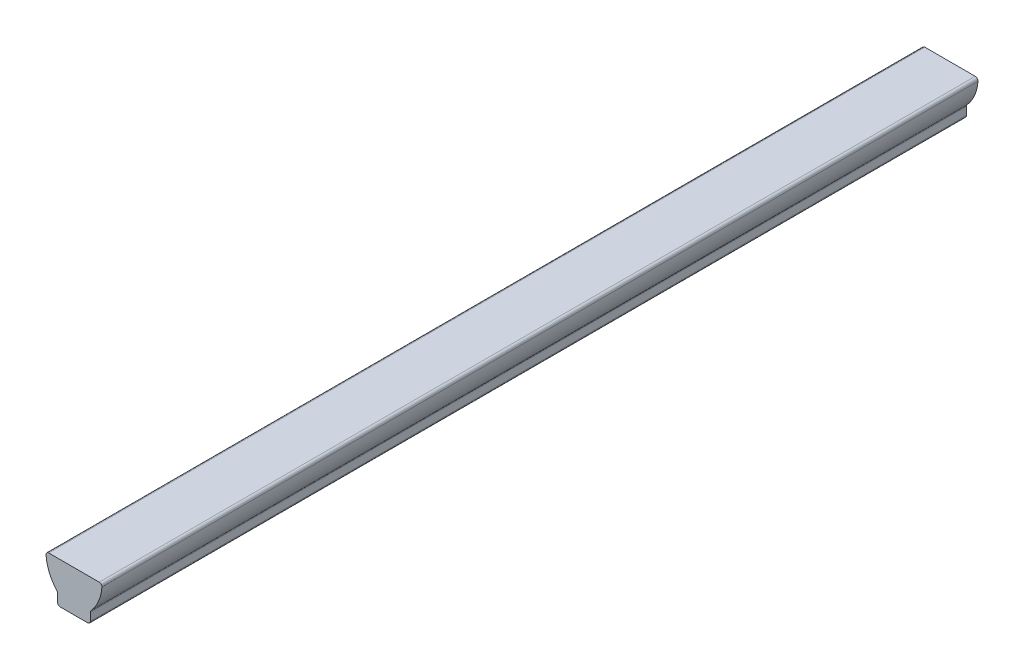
ISO-10303-21;
HEADER;
FILE_DESCRIPTION(('STEP AP214'),'2;1');
FILE_NAME('part.step','',(''),(''),'','','');
FILE_SCHEMA(('AUTOMOTIVE_DESIGN { 1 0 10303 214 1 1 1 1 }'));
ENDSEC;
DATA;
#1=APPLICATION_CONTEXT('core data for automotive mechanical design processes');
#2=APPLICATION_PROTOCOL_DEFINITION('international standard','automotive_design',2000,#1);
#3=PRODUCT_CONTEXT('',#1,'mechanical');
#4=PRODUCT('Part','Part','',(#3));
#5=PRODUCT_RELATED_PRODUCT_CATEGORY('part','',(#4));
#6=PRODUCT_DEFINITION_FORMATION('','',#4);
#7=PRODUCT_DEFINITION_CONTEXT('part definition',#1,'design');
#8=PRODUCT_DEFINITION('design','',#6,#7);
#9=PRODUCT_DEFINITION_SHAPE('','',#8);
#10=(LENGTH_UNIT() NAMED_UNIT(*) SI_UNIT(.MILLI.,.METRE.));
#11=(NAMED_UNIT(*) PLANE_ANGLE_UNIT() SI_UNIT($,.RADIAN.));
#12=(NAMED_UNIT(*) SI_UNIT($,.STERADIAN.) SOLID_ANGLE_UNIT());
#13=UNCERTAINTY_MEASURE_WITH_UNIT(LENGTH_MEASURE(1.E-05),#10,'distance_accuracy_value','');
#14=(GEOMETRIC_REPRESENTATION_CONTEXT(3) GLOBAL_UNCERTAINTY_ASSIGNED_CONTEXT((#13)) GLOBAL_UNIT_ASSIGNED_CONTEXT((#10,
#11,#12)) REPRESENTATION_CONTEXT('',''));
#15=CARTESIAN_POINT('',(0.,0.,0.));
#16=DIRECTION('',(0.,0.,1.));
#17=DIRECTION('',(1.,0.,0.));
#18=AXIS2_PLACEMENT_3D('',#15,#16,#17);
#19=CARTESIAN_POINT('',(-14.6269565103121,22.2123,508.));
#20=DIRECTION('',(0.,0.,-1.));
#21=DIRECTION('',(-1.,0.,0.));
#22=AXIS2_PLACEMENT_3D('',#19,#20,#21);
#23=CYLINDRICAL_SURFACE('',#22,1.5875);
#24=CARTESIAN_POINT('',(-14.6269565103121,22.2123,0.));
#25=DIRECTION('',(0.,0.,1.));
#26=DIRECTION('',(-1.,0.,0.));
#27=AXIS2_PLACEMENT_3D('',#24,#25,#26);
#28=CIRCLE('',#27,1.5875);
#29=CARTESIAN_POINT('',(-14.6269565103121,23.7998,0.));
#30=VERTEX_POINT('',#29);
#31=CARTESIAN_POINT('',(-16.21075392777,22.1039395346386,0.));
#32=VERTEX_POINT('',#31);
#33=EDGE_CURVE('E106',#30,#32,#28,.T.);
#34=ORIENTED_EDGE('',*,*,#33,.T.);
#35=DIRECTION('',(0.,0.,-1.));
#36=VECTOR('',#35,1.);
#37=CARTESIAN_POINT('',(-16.21075392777,22.1039395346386,508.));
#38=LINE('',#37,#36);
#39=CARTESIAN_POINT('',(-16.21075392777,22.1039395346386,508.));
#40=VERTEX_POINT('',#39);
#41=EDGE_CURVE('E9',#40,#32,#38,.T.);
#42=ORIENTED_EDGE('',*,*,#41,.F.);
#43=CARTESIAN_POINT('',(-14.6269565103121,22.2123,508.));
#44=DIRECTION('',(0.,0.,1.));
#45=DIRECTION('',(-1.,0.,0.));
#46=AXIS2_PLACEMENT_3D('',#43,#44,#45);
#47=CIRCLE('',#46,1.5875);
#48=CARTESIAN_POINT('',(-14.6269565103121,23.7998,508.));
#49=VERTEX_POINT('',#48);
#50=EDGE_CURVE('E141',#49,#40,#47,.T.);
#51=ORIENTED_EDGE('',*,*,#50,.F.);
#52=DIRECTION('',(0.,0.,-1.));
#53=VECTOR('',#52,1.);
#54=CARTESIAN_POINT('',(-14.6269565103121,23.7998,508.));
#55=LINE('',#54,#53);
#56=EDGE_CURVE('E119',#49,#30,#55,.T.);
#57=ORIENTED_EDGE('',*,*,#56,.T.);
#58=EDGE_LOOP('',(#34,#42,#51,#57));
#59=FACE_BOUND('',#58,.T.);
#60=ADVANCED_FACE('F14',(#59),#23,.T.);
#61=CARTESIAN_POINT('',(8.57595602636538,23.7998,508.));
#62=DIRECTION('',(0.,0.,-1.));
#63=DIRECTION('',(-1.,0.,0.));
#64=AXIS2_PLACEMENT_3D('',#61,#62,#63);
#65=CYLINDRICAL_SURFACE('',#64,24.8446560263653);
#66=CARTESIAN_POINT('',(8.57595602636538,23.7998,0.));
#67=DIRECTION('',(0.,0.,1.));
#68=DIRECTION('',(1.,0.,0.));
#69=AXIS2_PLACEMENT_3D('',#66,#67,#68);
#70=CIRCLE('',#69,24.8446560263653);
#71=CARTESIAN_POINT('',(-9.93002272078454,7.22313918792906,0.));
#72=VERTEX_POINT('',#71);
#73=EDGE_CURVE('E102',#32,#72,#70,.T.);
#74=ORIENTED_EDGE('',*,*,#73,.T.);
#75=DIRECTION('',(0.,0.,-1.));
#76=VECTOR('',#75,1.);
#77=CARTESIAN_POINT('',(-9.93002272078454,7.22313918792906,508.));
#78=LINE('',#77,#76);
#79=CARTESIAN_POINT('',(-9.93002272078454,7.22313918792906,508.));
#80=VERTEX_POINT('',#79);
#81=EDGE_CURVE('E21',#80,#72,#78,.T.);
#82=ORIENTED_EDGE('',*,*,#81,.F.);
#83=CARTESIAN_POINT('',(8.57595602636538,23.7998,508.));
#84=DIRECTION('',(0.,0.,1.));
#85=DIRECTION('',(1.,0.,0.));
#86=AXIS2_PLACEMENT_3D('',#83,#84,#85);
#87=CIRCLE('',#86,24.8446560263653);
#88=EDGE_CURVE('E115',#40,#80,#87,.T.);
#89=ORIENTED_EDGE('',*,*,#88,.F.);
#90=ORIENTED_EDGE('',*,*,#41,.T.);
#91=EDGE_LOOP('',(#74,#82,#89,#90));
#92=FACE_BOUND('',#91,.T.);
#93=ADVANCED_FACE('F114',(#92),#65,.T.);
#94=CARTESIAN_POINT('',(-11.1125,6.16393961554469,508.));
#95=DIRECTION('',(0.,0.,-1.));
#96=DIRECTION('',(-1.,0.,0.));
#97=AXIS2_PLACEMENT_3D('',#94,#95,#96);
#98=CYLINDRICAL_SURFACE('',#97,1.5875);
#99=CARTESIAN_POINT('',(-11.1125,6.16393961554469,0.));
#100=DIRECTION('',(0.,0.,-1.));
#101=DIRECTION('',(-1.,0.,0.));
#102=AXIS2_PLACEMENT_3D('',#99,#100,#101);
#103=CIRCLE('',#102,1.5875);
#104=CARTESIAN_POINT('',(-9.525,6.16393961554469,0.));
#105=VERTEX_POINT('',#104);
#106=EDGE_CURVE('E108',#72,#105,#103,.T.);
#107=ORIENTED_EDGE('',*,*,#106,.T.);
#108=DIRECTION('',(0.,0.,-1.));
#109=VECTOR('',#108,1.);
#110=CARTESIAN_POINT('',(-9.525,6.16393961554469,508.));
#111=LINE('',#110,#109);
#112=CARTESIAN_POINT('',(-9.525,6.16393961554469,508.));
#113=VERTEX_POINT('',#112);
#114=EDGE_CURVE('E187',#113,#105,#111,.T.);
#115=ORIENTED_EDGE('',*,*,#114,.F.);
#116=CARTESIAN_POINT('',(-11.1125,6.16393961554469,508.));
#117=DIRECTION('',(0.,0.,-1.));
#118=DIRECTION('',(-1.,0.,0.));
#119=AXIS2_PLACEMENT_3D('',#116,#117,#118);
#120=CIRCLE('',#119,1.5875);
#121=EDGE_CURVE('E144',#80,#113,#120,.T.);
#122=ORIENTED_EDGE('',*,*,#121,.F.);
#123=ORIENTED_EDGE('',*,*,#81,.T.);
#124=EDGE_LOOP('',(#107,#115,#122,#123));
#125=FACE_BOUND('',#124,.T.);
#126=ADVANCED_FACE('F191',(#125),#98,.F.);
#127=CARTESIAN_POINT('',(-9.525,1.5875,508.));
#128=DIRECTION('',(1.,0.,0.));
#129=DIRECTION('',(0.,0.,-1.));
#130=AXIS2_PLACEMENT_3D('',#127,#128,#129);
#131=PLANE('',#130);
#132=DIRECTION('',(0.,-1.,0.));
#133=VECTOR('',#132,1.);
#134=CARTESIAN_POINT('',(-9.525,1.5875,0.));
#135=LINE('',#134,#133);
#136=CARTESIAN_POINT('',(-9.525,1.5875,0.));
#137=VERTEX_POINT('',#136);
#138=EDGE_CURVE('E123',#105,#137,#135,.T.);
#139=ORIENTED_EDGE('',*,*,#138,.T.);
#140=DIRECTION('',(0.,0.,-1.));
#141=VECTOR('',#140,1.);
#142=CARTESIAN_POINT('',(-9.525,1.5875,508.));
#143=LINE('',#142,#141);
#144=CARTESIAN_POINT('',(-9.525,1.5875,508.));
#145=VERTEX_POINT('',#144);
#146=EDGE_CURVE('E184',#145,#137,#143,.T.);
#147=ORIENTED_EDGE('',*,*,#146,.F.);
#148=DIRECTION('',(0.,-1.,0.));
#149=VECTOR('',#148,1.);
#150=CARTESIAN_POINT('',(-9.525,1.5875,508.));
#151=LINE('',#150,#149);
#152=EDGE_CURVE('E146',#113,#145,#151,.T.);
#153=ORIENTED_EDGE('',*,*,#152,.F.);
#154=ORIENTED_EDGE('',*,*,#114,.T.);
#155=EDGE_LOOP('',(#139,#147,#153,#154));
#156=FACE_BOUND('',#155,.T.);
#157=ADVANCED_FACE('F199',(#156),#131,.F.);
#158=CARTESIAN_POINT('',(-7.9375,1.5875,508.));
#159=DIRECTION('',(0.,0.,-1.));
#160=DIRECTION('',(-1.,0.,0.));
#161=AXIS2_PLACEMENT_3D('',#158,#159,#160);
#162=CYLINDRICAL_SURFACE('',#161,1.5875);
#163=CARTESIAN_POINT('',(-7.9375,1.5875,0.));
#164=DIRECTION('',(0.,0.,1.));
#165=DIRECTION('',(1.,0.,0.));
#166=AXIS2_PLACEMENT_3D('',#163,#164,#165);
#167=CIRCLE('',#166,1.5875);
#168=CARTESIAN_POINT('',(-7.9375,0.,0.));
#169=VERTEX_POINT('',#168);
#170=EDGE_CURVE('E125',#137,#169,#167,.T.);
#171=ORIENTED_EDGE('',*,*,#170,.T.);
#172=DIRECTION('',(0.,0.,-1.));
#173=VECTOR('',#172,1.);
#174=CARTESIAN_POINT('',(-7.9375,0.,508.));
#175=LINE('',#174,#173);
#176=CARTESIAN_POINT('',(-7.9375,0.,508.));
#177=VERTEX_POINT('',#176);
#178=EDGE_CURVE('E181',#177,#169,#175,.T.);
#179=ORIENTED_EDGE('',*,*,#178,.F.);
#180=CARTESIAN_POINT('',(-7.9375,1.5875,508.));
#181=DIRECTION('',(0.,0.,1.));
#182=DIRECTION('',(1.,0.,0.));
#183=AXIS2_PLACEMENT_3D('',#180,#181,#182);
#184=CIRCLE('',#183,1.5875);
#185=EDGE_CURVE('E148',#145,#177,#184,.T.);
#186=ORIENTED_EDGE('',*,*,#185,.F.);
#187=ORIENTED_EDGE('',*,*,#146,.T.);
#188=EDGE_LOOP('',(#171,#179,#186,#187));
#189=FACE_BOUND('',#188,.T.);
#190=ADVANCED_FACE('F202',(#189),#162,.T.);
#191=CARTESIAN_POINT('',(-7.9375,0.,508.));
#192=DIRECTION('',(0.,1.,0.));
#193=DIRECTION('',(0.,0.,1.));
#194=AXIS2_PLACEMENT_3D('',#191,#192,#193);
#195=PLANE('',#194);
#196=DIRECTION('',(1.,0.,0.));
#197=VECTOR('',#196,1.);
#198=CARTESIAN_POINT('',(-7.9375,0.,0.));
#199=LINE('',#198,#197);
#200=CARTESIAN_POINT('',(7.9375,0.,0.));
#201=VERTEX_POINT('',#200);
#202=EDGE_CURVE('E127',#169,#201,#199,.T.);
#203=ORIENTED_EDGE('',*,*,#202,.T.);
#204=DIRECTION('',(0.,0.,-1.));
#205=VECTOR('',#204,1.);
#206=CARTESIAN_POINT('',(7.9375,0.,508.));
#207=LINE('',#206,#205);
#208=CARTESIAN_POINT('',(7.9375,0.,508.));
#209=VERTEX_POINT('',#208);
#210=EDGE_CURVE('E178',#209,#201,#207,.T.);
#211=ORIENTED_EDGE('',*,*,#210,.F.);
#212=DIRECTION('',(1.,0.,0.));
#213=VECTOR('',#212,1.);
#214=CARTESIAN_POINT('',(-7.9375,0.,508.));
#215=LINE('',#214,#213);
#216=EDGE_CURVE('E150',#177,#209,#215,.T.);
#217=ORIENTED_EDGE('',*,*,#216,.F.);
#218=ORIENTED_EDGE('',*,*,#178,.T.);
#219=EDGE_LOOP('',(#203,#211,#217,#218));
#220=FACE_BOUND('',#219,.T.);
#221=ADVANCED_FACE('F207',(#220),#195,.F.);
#222=CARTESIAN_POINT('',(7.9375,1.5875,508.));
#223=DIRECTION('',(0.,0.,-1.));
#224=DIRECTION('',(-1.,0.,0.));
#225=AXIS2_PLACEMENT_3D('',#222,#223,#224);
#226=CYLINDRICAL_SURFACE('',#225,1.5875);
#227=CARTESIAN_POINT('',(7.9375,1.5875,0.));
#228=DIRECTION('',(0.,0.,1.));
#229=DIRECTION('',(1.,0.,0.));
#230=AXIS2_PLACEMENT_3D('',#227,#228,#229);
#231=CIRCLE('',#230,1.5875);
#232=CARTESIAN_POINT('',(9.525,1.5875,0.));
#233=VERTEX_POINT('',#232);
#234=EDGE_CURVE('E129',#201,#233,#231,.T.);
#235=ORIENTED_EDGE('',*,*,#234,.T.);
#236=DIRECTION('',(0.,0.,-1.));
#237=VECTOR('',#236,1.);
#238=CARTESIAN_POINT('',(9.525,1.5875,508.));
#239=LINE('',#238,#237);
#240=CARTESIAN_POINT('',(9.525,1.5875,508.));
#241=VERTEX_POINT('',#240);
#242=EDGE_CURVE('E175',#241,#233,#239,.T.);
#243=ORIENTED_EDGE('',*,*,#242,.F.);
#244=CARTESIAN_POINT('',(7.9375,1.5875,508.));
#245=DIRECTION('',(0.,0.,1.));
#246=DIRECTION('',(1.,0.,0.));
#247=AXIS2_PLACEMENT_3D('',#244,#245,#246);
#248=CIRCLE('',#247,1.5875);
#249=EDGE_CURVE('E152',#209,#241,#248,.T.);
#250=ORIENTED_EDGE('',*,*,#249,.F.);
#251=ORIENTED_EDGE('',*,*,#210,.T.);
#252=EDGE_LOOP('',(#235,#243,#250,#251));
#253=FACE_BOUND('',#252,.T.);
#254=ADVANCED_FACE('F213',(#253),#226,.T.);
#255=CARTESIAN_POINT('',(9.525,1.5875,508.));
#256=DIRECTION('',(-1.,0.,0.));
#257=DIRECTION('',(0.,0.,1.));
#258=AXIS2_PLACEMENT_3D('',#255,#256,#257);
#259=PLANE('',#258);
#260=DIRECTION('',(0.,1.,0.));
#261=VECTOR('',#260,1.);
#262=CARTESIAN_POINT('',(9.525,1.5875,0.));
#263=LINE('',#262,#261);
#264=CARTESIAN_POINT('',(9.525,6.16393961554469,0.));
#265=VERTEX_POINT('',#264);
#266=EDGE_CURVE('E131',#233,#265,#263,.T.);
#267=ORIENTED_EDGE('',*,*,#266,.T.);
#268=DIRECTION('',(0.,0.,-1.));
#269=VECTOR('',#268,1.);
#270=CARTESIAN_POINT('',(9.525,6.16393961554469,508.));
#271=LINE('',#270,#269);
#272=CARTESIAN_POINT('',(9.525,6.16393961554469,508.));
#273=VERTEX_POINT('',#272);
#274=EDGE_CURVE('E172',#273,#265,#271,.T.);
#275=ORIENTED_EDGE('',*,*,#274,.F.);
#276=DIRECTION('',(0.,1.,0.));
#277=VECTOR('',#276,1.);
#278=CARTESIAN_POINT('',(9.525,1.5875,508.));
#279=LINE('',#278,#277);
#280=EDGE_CURVE('E154',#241,#273,#279,.T.);
#281=ORIENTED_EDGE('',*,*,#280,.F.);
#282=ORIENTED_EDGE('',*,*,#242,.T.);
#283=EDGE_LOOP('',(#267,#275,#281,#282));
#284=FACE_BOUND('',#283,.T.);
#285=ADVANCED_FACE('F217',(#284),#259,.F.);
#286=CARTESIAN_POINT('',(11.1125,6.16393961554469,508.));
#287=DIRECTION('',(0.,0.,-1.));
#288=DIRECTION('',(-1.,0.,0.));
#289=AXIS2_PLACEMENT_3D('',#286,#287,#288);
#290=CYLINDRICAL_SURFACE('',#289,1.5875);
#291=CARTESIAN_POINT('',(11.1125,6.16393961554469,0.));
#292=DIRECTION('',(0.,0.,-1.));
#293=DIRECTION('',(-1.,0.,0.));
#294=AXIS2_PLACEMENT_3D('',#291,#292,#293);
#295=CIRCLE('',#294,1.5875);
#296=CARTESIAN_POINT('',(9.93002272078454,7.22313918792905,0.));
#297=VERTEX_POINT('',#296);
#298=EDGE_CURVE('E133',#265,#297,#295,.T.);
#299=ORIENTED_EDGE('',*,*,#298,.T.);
#300=DIRECTION('',(0.,0.,-1.));
#301=VECTOR('',#300,1.);
#302=CARTESIAN_POINT('',(9.93002272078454,7.22313918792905,508.));
#303=LINE('',#302,#301);
#304=CARTESIAN_POINT('',(9.93002272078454,7.22313918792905,508.));
#305=VERTEX_POINT('',#304);
#306=EDGE_CURVE('E169',#305,#297,#303,.T.);
#307=ORIENTED_EDGE('',*,*,#306,.F.);
#308=CARTESIAN_POINT('',(11.1125,6.16393961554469,508.));
#309=DIRECTION('',(0.,0.,-1.));
#310=DIRECTION('',(-1.,0.,0.));
#311=AXIS2_PLACEMENT_3D('',#308,#309,#310);
#312=CIRCLE('',#311,1.5875);
#313=EDGE_CURVE('E156',#273,#305,#312,.T.);
#314=ORIENTED_EDGE('',*,*,#313,.F.);
#315=ORIENTED_EDGE('',*,*,#274,.T.);
#316=EDGE_LOOP('',(#299,#307,#314,#315));
#317=FACE_BOUND('',#316,.T.);
#318=ADVANCED_FACE('F222',(#317),#290,.F.);
#319=CARTESIAN_POINT('',(-8.57595602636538,23.7998,508.));
#320=DIRECTION('',(0.,0.,-1.));
#321=DIRECTION('',(-1.,0.,0.));
#322=AXIS2_PLACEMENT_3D('',#319,#320,#321);
#323=CYLINDRICAL_SURFACE('',#322,24.8446560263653);
#324=CARTESIAN_POINT('',(-8.57595602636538,23.7998,0.));
#325=DIRECTION('',(0.,0.,1.));
#326=DIRECTION('',(-1.,0.,0.));
#327=AXIS2_PLACEMENT_3D('',#324,#325,#326);
#328=CIRCLE('',#327,24.8446560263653);
#329=CARTESIAN_POINT('',(16.21075392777,22.1039395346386,0.));
#330=VERTEX_POINT('',#329);
#331=EDGE_CURVE('E135',#297,#330,#328,.T.);
#332=ORIENTED_EDGE('',*,*,#331,.T.);
#333=DIRECTION('',(0.,0.,-1.));
#334=VECTOR('',#333,1.);
#335=CARTESIAN_POINT('',(16.21075392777,22.1039395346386,508.));
#336=LINE('',#335,#334);
#337=CARTESIAN_POINT('',(16.21075392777,22.1039395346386,508.));
#338=VERTEX_POINT('',#337);
#339=EDGE_CURVE('E166',#338,#330,#336,.T.);
#340=ORIENTED_EDGE('',*,*,#339,.F.);
#341=CARTESIAN_POINT('',(-8.57595602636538,23.7998,508.));
#342=DIRECTION('',(0.,0.,1.));
#343=DIRECTION('',(-1.,0.,0.));
#344=AXIS2_PLACEMENT_3D('',#341,#342,#343);
#345=CIRCLE('',#344,24.8446560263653);
#346=EDGE_CURVE('E158',#305,#338,#345,.T.);
#347=ORIENTED_EDGE('',*,*,#346,.F.);
#348=ORIENTED_EDGE('',*,*,#306,.T.);
#349=EDGE_LOOP('',(#332,#340,#347,#348));
#350=FACE_BOUND('',#349,.T.);
#351=ADVANCED_FACE('F226',(#350),#323,.T.);
#352=CARTESIAN_POINT('',(14.6269565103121,22.2123,508.));
#353=DIRECTION('',(0.,0.,-1.));
#354=DIRECTION('',(-1.,0.,0.));
#355=AXIS2_PLACEMENT_3D('',#352,#353,#354);
#356=CYLINDRICAL_SURFACE('',#355,1.5875);
#357=CARTESIAN_POINT('',(14.6269565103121,22.2123,0.));
#358=DIRECTION('',(0.,0.,1.));
#359=DIRECTION('',(-1.,0.,0.));
#360=AXIS2_PLACEMENT_3D('',#357,#358,#359);
#361=CIRCLE('',#360,1.5875);
#362=CARTESIAN_POINT('',(14.6269565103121,23.7998,0.));
#363=VERTEX_POINT('',#362);
#364=EDGE_CURVE('E137',#330,#363,#361,.T.);
#365=ORIENTED_EDGE('',*,*,#364,.T.);
#366=DIRECTION('',(0.,0.,-1.));
#367=VECTOR('',#366,1.);
#368=CARTESIAN_POINT('',(14.6269565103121,23.7998,508.));
#369=LINE('',#368,#367);
#370=CARTESIAN_POINT('',(14.6269565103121,23.7998,508.));
#371=VERTEX_POINT('',#370);
#372=EDGE_CURVE('E163',#371,#363,#369,.T.);
#373=ORIENTED_EDGE('',*,*,#372,.F.);
#374=CARTESIAN_POINT('',(14.6269565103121,22.2123,508.));
#375=DIRECTION('',(0.,0.,1.));
#376=DIRECTION('',(-1.,0.,0.));
#377=AXIS2_PLACEMENT_3D('',#374,#375,#376);
#378=CIRCLE('',#377,1.5875);
#379=EDGE_CURVE('E33',#338,#371,#378,.T.);
#380=ORIENTED_EDGE('',*,*,#379,.F.);
#381=ORIENTED_EDGE('',*,*,#339,.T.);
#382=EDGE_LOOP('',(#365,#373,#380,#381));
#383=FACE_BOUND('',#382,.T.);
#384=ADVANCED_FACE('F230',(#383),#356,.T.);
#385=CARTESIAN_POINT('',(-14.6269565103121,23.7998,508.));
#386=DIRECTION('',(0.,-1.,0.));
#387=DIRECTION('',(0.,0.,-1.));
#388=AXIS2_PLACEMENT_3D('',#385,#386,#387);
#389=PLANE('',#388);
#390=DIRECTION('',(-1.,0.,0.));
#391=VECTOR('',#390,1.);
#392=CARTESIAN_POINT('',(-14.6269565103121,23.7998,0.));
#393=LINE('',#392,#391);
#394=EDGE_CURVE('E139',#363,#30,#393,.T.);
#395=ORIENTED_EDGE('',*,*,#394,.T.);
#396=ORIENTED_EDGE('',*,*,#56,.F.);
#397=DIRECTION('',(-1.,0.,0.));
#398=VECTOR('',#397,1.);
#399=CARTESIAN_POINT('',(-14.6269565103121,23.7998,508.));
#400=LINE('',#399,#398);
#401=EDGE_CURVE('E28',#371,#49,#400,.T.);
#402=ORIENTED_EDGE('',*,*,#401,.F.);
#403=ORIENTED_EDGE('',*,*,#372,.T.);
#404=EDGE_LOOP('',(#395,#396,#402,#403));
#405=FACE_BOUND('',#404,.T.);
#406=ADVANCED_FACE('F232',(#405),#389,.F.);
#407=CARTESIAN_POINT('',(-14.6269565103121,22.2123,508.));
#408=DIRECTION('',(0.,0.,-1.));
#409=DIRECTION('',(-1.,0.,0.));
#410=AXIS2_PLACEMENT_3D('',#407,#408,#409);
#411=PLANE('',#410);
#412=ORIENTED_EDGE('',*,*,#50,.T.);
#413=ORIENTED_EDGE('',*,*,#88,.T.);
#414=ORIENTED_EDGE('',*,*,#121,.T.);
#415=ORIENTED_EDGE('',*,*,#152,.T.);
#416=ORIENTED_EDGE('',*,*,#185,.T.);
#417=ORIENTED_EDGE('',*,*,#216,.T.);
#418=ORIENTED_EDGE('',*,*,#249,.T.);
#419=ORIENTED_EDGE('',*,*,#280,.T.);
#420=ORIENTED_EDGE('',*,*,#313,.T.);
#421=ORIENTED_EDGE('',*,*,#346,.T.);
#422=ORIENTED_EDGE('',*,*,#379,.T.);
#423=ORIENTED_EDGE('',*,*,#401,.T.);
#424=EDGE_LOOP('',(#412,#413,#414,#415,#416,#417,#418,#419,#420,#421,#422,#423));
#425=FACE_BOUND('',#424,.T.);
#426=ADVANCED_FACE('F194',(#425),#411,.F.);
#427=CARTESIAN_POINT('',(-14.6269565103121,22.2123,0.));
#428=DIRECTION('',(0.,0.,-1.));
#429=DIRECTION('',(-1.,0.,0.));
#430=AXIS2_PLACEMENT_3D('',#427,#428,#429);
#431=PLANE('',#430);
#432=ORIENTED_EDGE('',*,*,#33,.F.);
#433=ORIENTED_EDGE('',*,*,#394,.F.);
#434=ORIENTED_EDGE('',*,*,#364,.F.);
#435=ORIENTED_EDGE('',*,*,#331,.F.);
#436=ORIENTED_EDGE('',*,*,#298,.F.);
#437=ORIENTED_EDGE('',*,*,#266,.F.);
#438=ORIENTED_EDGE('',*,*,#234,.F.);
#439=ORIENTED_EDGE('',*,*,#202,.F.);
#440=ORIENTED_EDGE('',*,*,#170,.F.);
#441=ORIENTED_EDGE('',*,*,#138,.F.);
#442=ORIENTED_EDGE('',*,*,#106,.F.);
#443=ORIENTED_EDGE('',*,*,#73,.F.);
#444=EDGE_LOOP('',(#432,#433,#434,#435,#436,#437,#438,#439,#440,#441,#442,#443));
#445=FACE_BOUND('',#444,.T.);
#446=ADVANCED_FACE('F103',(#445),#431,.T.);
#447=CLOSED_SHELL('',(#60,#93,#126,#157,#190,#221,#254,#285,#318,#351,#384,#406,#426,#446));
#448=MANIFOLD_SOLID_BREP('B1',#447);
#449=ADVANCED_BREP_SHAPE_REPRESENTATION('',(#18,#448),#14);
#450=SHAPE_DEFINITION_REPRESENTATION(#9,#449);
ENDSEC;
END-ISO-10303-21;
